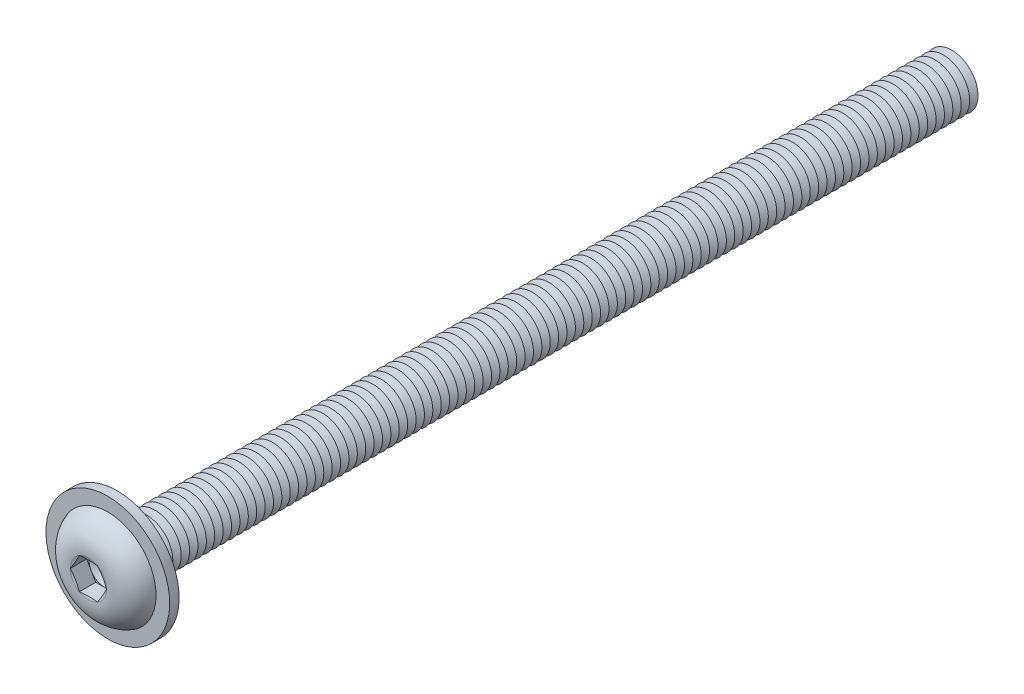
from build123d import *

# Parameters (mm, degrees)
FILLET1_R           = 0.4
LPATTERN1_COUNT     = 100
LPATTERN1_PITCH     = 0.8
CUT_EXTRUDE1_DEPTH  = 1.56
SKETCH5_R           = 5.9
SKETCH5_R_2         = 2.9
BOSS_EXTRUDE1_DEPTH = 0.9


with BuildPart() as part:
    # Sketch1 → Revolve1 (revolve)
    with BuildSketch(Plane(origin=(0, 0, 0), x_dir=(0, 0, -1), z_dir=(1, 0, 0))):
        with BuildLine():
            Line((0, 2.5), (0, 4.75))
            ThreePointArc((0, 4.75), (-2.041477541, 3.848329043), (-2.75, 1.73205))
            Line((-2.75, 1.73205), (-2.517949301, 0.866025))
            Line((-2.517949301, 0.866025), (-2.75, 0.866025))
            Line((-2.75, 0.866025), (-2.75, 0))
            Line((-2.75, 0), (80, 0))
            Line((80, 0), (80, 2.5))
            Line((80, 2.5), (0, 2.5))
        make_face()
    revolve(axis=Axis((0, 0, -80), (0, 0, 1)))

    # Fillet1
    fillet1_edges = [part.edges().sort_by_distance(p)[0] for p in [
        (0, -2.5, 0),
    ]]
    fillet(fillet1_edges, radius=FILLET1_R)

    # Sketch2 → Cut-Revolve1 (revolve, cut)
    with BuildSketch(Plane(origin=(0, 0, 0), x_dir=(0, 0, -1), z_dir=(1, 0, 0))):
        Polygon((79.6, 2.5), (80.4, 2.5), (80, 1.807179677), align=None)
    cut_revolve1 = revolve(axis=Axis((0, 0, -80), (0, 0, -1)), mode=Mode.SUBTRACT)

    # LPattern1: Cut-Revolve1 ×100
    with Locations(*[(0, 0, i * LPATTERN1_PITCH) for i in range(1, LPATTERN1_COUNT)]):
        add(cut_revolve1, mode=Mode.SUBTRACT)

    # Sketch3 → Cut-Extrude1 (cut)
    with BuildSketch(Plane.XY.offset(2.75)):
        Polygon((0.866025, 1.499999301), (-0.866025, 1.499999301), (-1.73205, 0), (-0.866025, -1.499999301), (0.866025, -1.499999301), (1.73205, 0), align=None)
    extrude(amount=-CUT_EXTRUDE1_DEPTH, mode=Mode.SUBTRACT)

    # Cut-Extrude2 cone 1 section (on through the dimple's axis) → Cut-Extrude2 (revolve, cut)
    with BuildSketch(Plane(origin=(0, 0, 1.19), x_dir=(0, -1, 0), z_dir=(1, 0, 0))):
        Polygon((0, 0), (1.499999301, 0), (0, 0.866025), align=None)
    revolve(axis=Axis((0, 0, 1.19), (0, 0, -1)), mode=Mode.SUBTRACT)

    # Sketch5 → Boss-Extrude1 (add)
    with BuildSketch(Plane(origin=(0, 0, 0), x_dir=(-1, 0, 0), z_dir=(0, 0, -1))):
        with Locations(Location((0, 0, 0), (0, 0, 90))):
            Circle(SKETCH5_R)
        Circle(SKETCH5_R_2, mode=Mode.SUBTRACT)
    extrude(amount=-BOSS_EXTRUDE1_DEPTH)


solid = part.part
